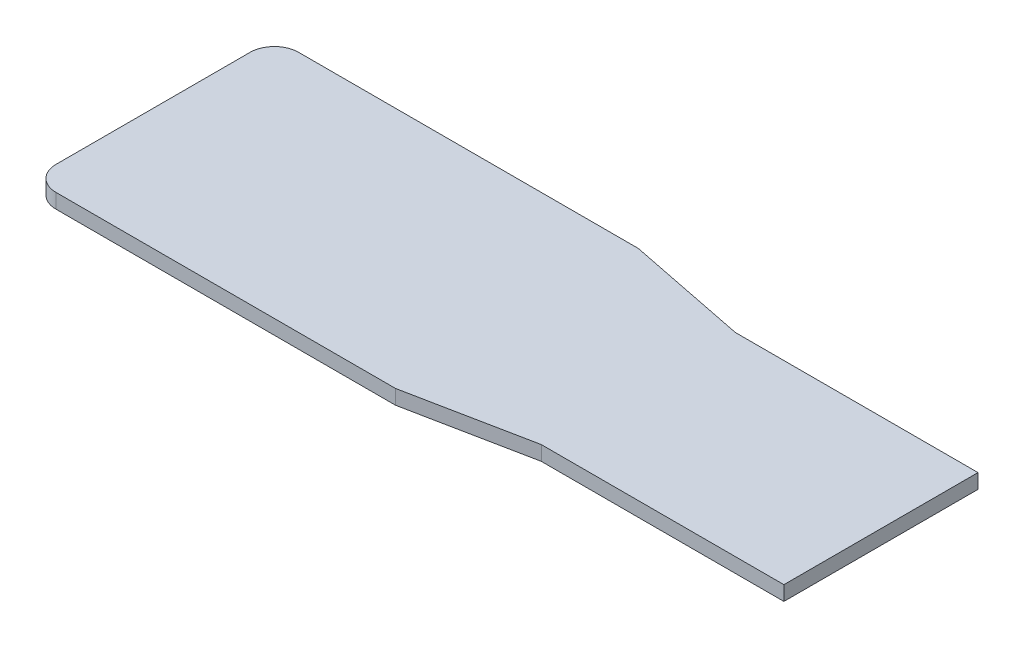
from build123d import *

# Parameters (mm, degrees)
BOSS_EXTRUDE1_DEPTH = 0.762


with BuildPart() as part:
    # Sketch1 → Boss-Extrude1 (new body)
    with BuildSketch(Plane(origin=(0, 0, 0), x_dir=(1, 0, 0), z_dir=(0, 1, 0))):
        with BuildLine():
            Line((19.05, 6.35), (25.4, 5.08))
            Line((25.4, 5.08), (38.1, 5.08))
            Line((38.1, 5.08), (38.1, -5.08))
            Line((38.1, -5.08), (25.4, -5.08))
            Line((25.4, -5.08), (19.05, -6.35))
            Line((19.05, -6.35), (1.27, -6.35))
            ThreePointArc((1.27, -6.35), (0.371974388, -5.978025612), (0, -5.08))
            Line((0, -5.08), (0, 5.08))
            ThreePointArc((0, 5.08), (0.371974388, 5.978025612), (1.27, 6.35))
            Line((1.27, 6.35), (19.05, 6.35))
        make_face()
    extrude(amount=BOSS_EXTRUDE1_DEPTH)


solid = part.part
